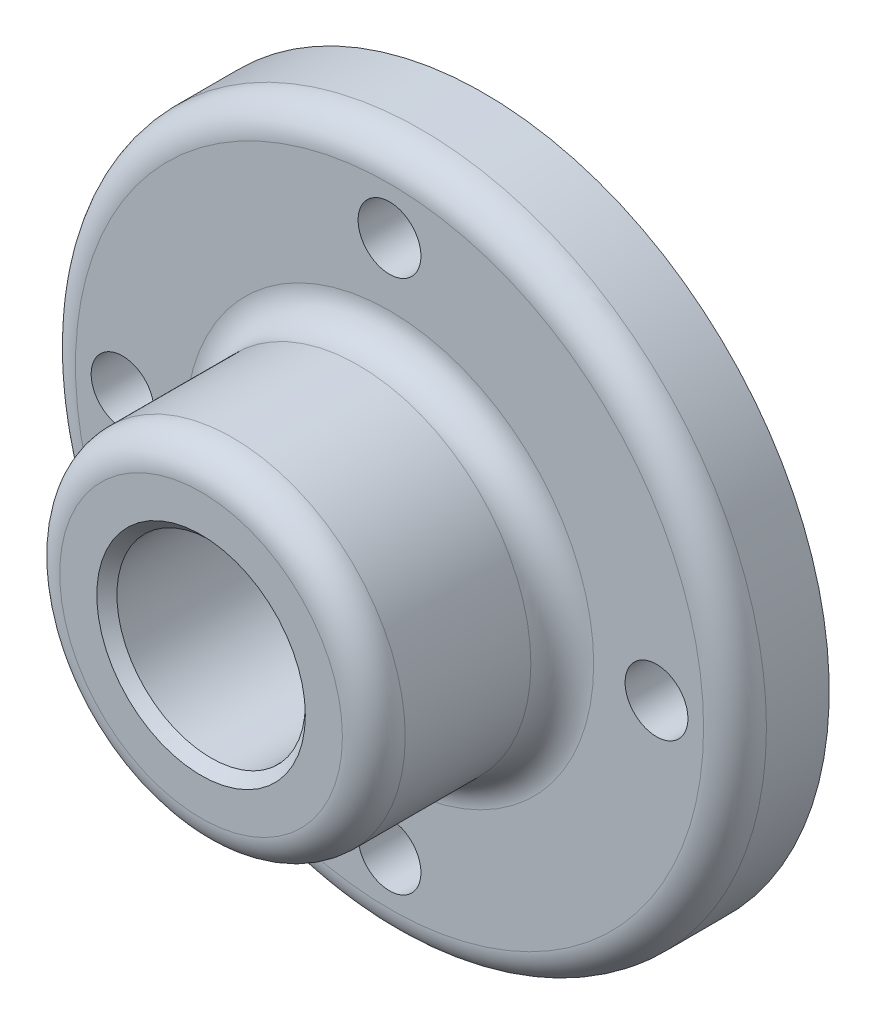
from build123d import *

# Parameters (mm, degrees)
SKETCH1_R          = 69.85
EXTRUDE1_DEPTH     = 19.05
EXTRUDE2_REACH     = 116.123
SKETCH2_R          = 34.925
SKETCH4_R          = 19.05
CUT_EXTRUDE1_DEPTH = 115.123474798
SKETCH5_R          = 6.35
CUT_EXTRUDE2_DEPTH = 106.875658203
CIRPATTERN1_COUNT  = 4
FILLET1_R          = 6.35
CHAMFER1_SIZE      = 2.032


with BuildPart() as part:
    # Sketch1 → Extrude1 (new body)
    with BuildSketch(Plane.XY):
        with Locations(Location((0, 0, 0), (0, 0, 180))):
            Circle(SKETCH1_R)
    extrude(amount=EXTRUDE1_DEPTH)

    # Sketch2 → Extrude2 (add, up to next)
    with BuildSketch(Plane.XY.offset(57.15), mode=Mode.PRIVATE) as extrude2_sk1:
        Circle(SKETCH2_R)
    extrude2_tool1 = extrude(extrude2_sk1.sketch, amount=-EXTRUDE2_REACH, mode=Mode.PRIVATE) - part.part
    add(extrude2_tool1.solids().sort_by_distance((0, 0, 57.15))[0])

    # Sketch4 → Cut-Extrude1 (cut, through all)
    with BuildSketch(Plane.XY.offset(57.15)):
        Circle(SKETCH4_R)
    extrude(amount=-CUT_EXTRUDE1_DEPTH, mode=Mode.SUBTRACT)

    # Sketch5 → Cut-Extrude2 (cut, through all)
    with BuildSketch(Plane.XY.offset(19.05)):
        with Locations((0, 53.975)):
            Circle(SKETCH5_R)
    cut_extrude2 = extrude(amount=-CUT_EXTRUDE2_DEPTH, mode=Mode.SUBTRACT)

    # CirPattern1: Cut-Extrude2 ×4 about axis
    cirpattern1_axis = Axis((0, 0, 0), (0, 0, 1))
    for i in range(1, CIRPATTERN1_COUNT):
        add(cut_extrude2.rotate(cirpattern1_axis, i * 360 / CIRPATTERN1_COUNT), mode=Mode.SUBTRACT)

    # Fillet1
    fillet1_edges = [part.edges().sort_by_distance(p)[0] for p in [
        (69.85, 0, 19.05),
        (-34.925, 0, 19.05),
        (-34.925, 0, 57.15),
    ]]
    fillet(fillet1_edges, radius=FILLET1_R)

    # Chamfer1
    chamfer1_edges = [part.edges().sort_by_distance(p)[0] for p in [
        (-19.05, 0, 57.15),
    ]]
    chamfer(chamfer1_edges, length=CHAMFER1_SIZE)


solid = part.part
